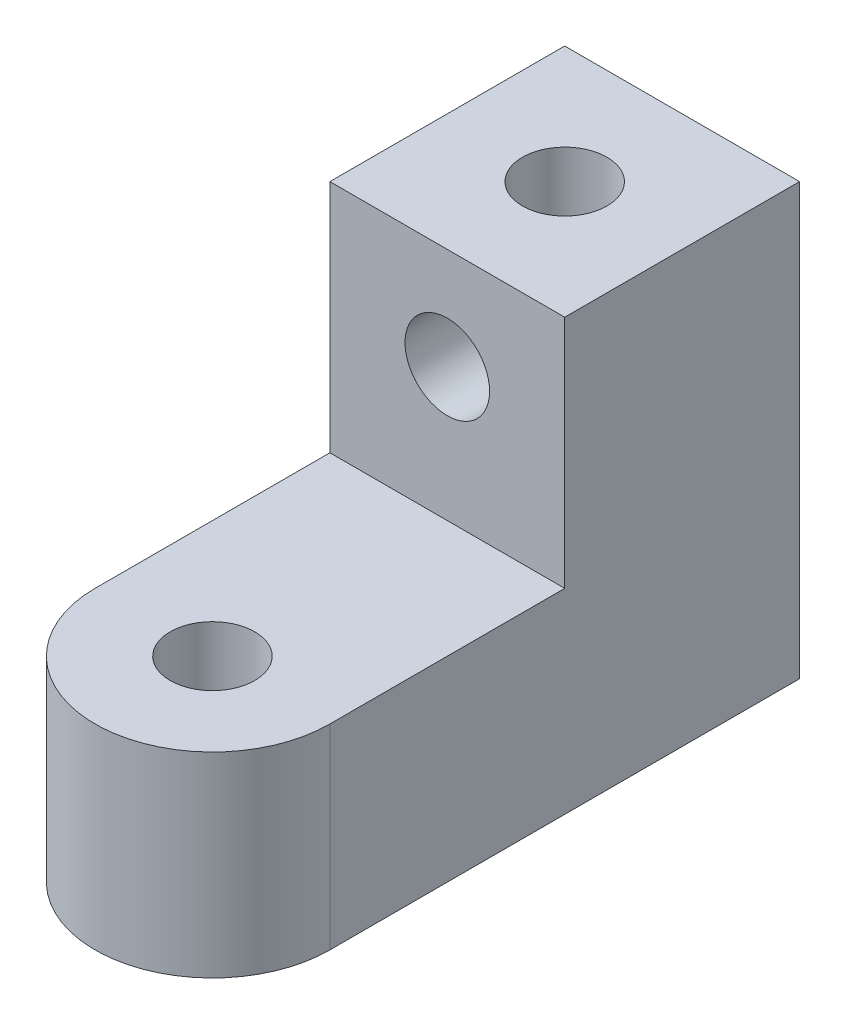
from build123d import *

# Parameters (mm, degrees)
EXTRUDE1_DEPTH                    = 25
SKETCH6_W                         = 30
SKETCH6_H                         = 30
EXTRUDE2_DEPTH                    = 30
M12X1_25_TAPPED_HOLE4_D           = 10.8
M12X1_25_TAPPED_HOLE4_ON_FACE_2_D = 10.8
M12X1_25_TAPPED_HOLE4_ON_FACE_3_D = 10.8


with BuildPart() as part:
    # Sketch1 → Extrude1 (new body)
    with BuildSketch(Plane(origin=(0, 0, 0), x_dir=(1, 0, 0), z_dir=(0, 1, 0))):
        with BuildLine():
            Line((-15, 0), (15, 0))
            Line((15, 0), (15, -60))
            ThreePointArc((15, -60), (0, -75), (-15, -60))
            Line((-15, -60), (-15, 0))
        make_face()
    extrude(amount=EXTRUDE1_DEPTH)

    # Sketch6 → Extrude2 (add)
    with BuildSketch(Plane(origin=(0, 25, 0), x_dir=(-1, 0, 0), z_dir=(0, 1, 0))):
        with Locations((0, 15)):
            Rectangle(SKETCH6_W, SKETCH6_H)
    extrude(amount=EXTRUDE2_DEPTH)

    # M12x1.25 Tapped Hole4 (through all)
    with Locations(Plane(origin=(0, 25, 60), x_dir=(0, 0, 1), z_dir=(0, 1, 0))):
        with Locations((0, 0)):
            Hole(M12X1_25_TAPPED_HOLE4_D / 2)

    # M12x1.25 Tapped Hole4 on face 2 (through all)
    with Locations(Plane(origin=(0, 42, 30), x_dir=(1, 0, 0), z_dir=(0, 0, 1))):
        with Locations((0, 0)):
            Hole(M12X1_25_TAPPED_HOLE4_ON_FACE_2_D / 2)

    # M12x1.25 Tapped Hole4 on face 3 (through all)
    with Locations(Plane(origin=(0, 55, 15), x_dir=(0, 0, 1), z_dir=(0, 1, 0))):
        with Locations((0, 0)):
            Hole(M12X1_25_TAPPED_HOLE4_ON_FACE_3_D / 2)


solid = part.part
